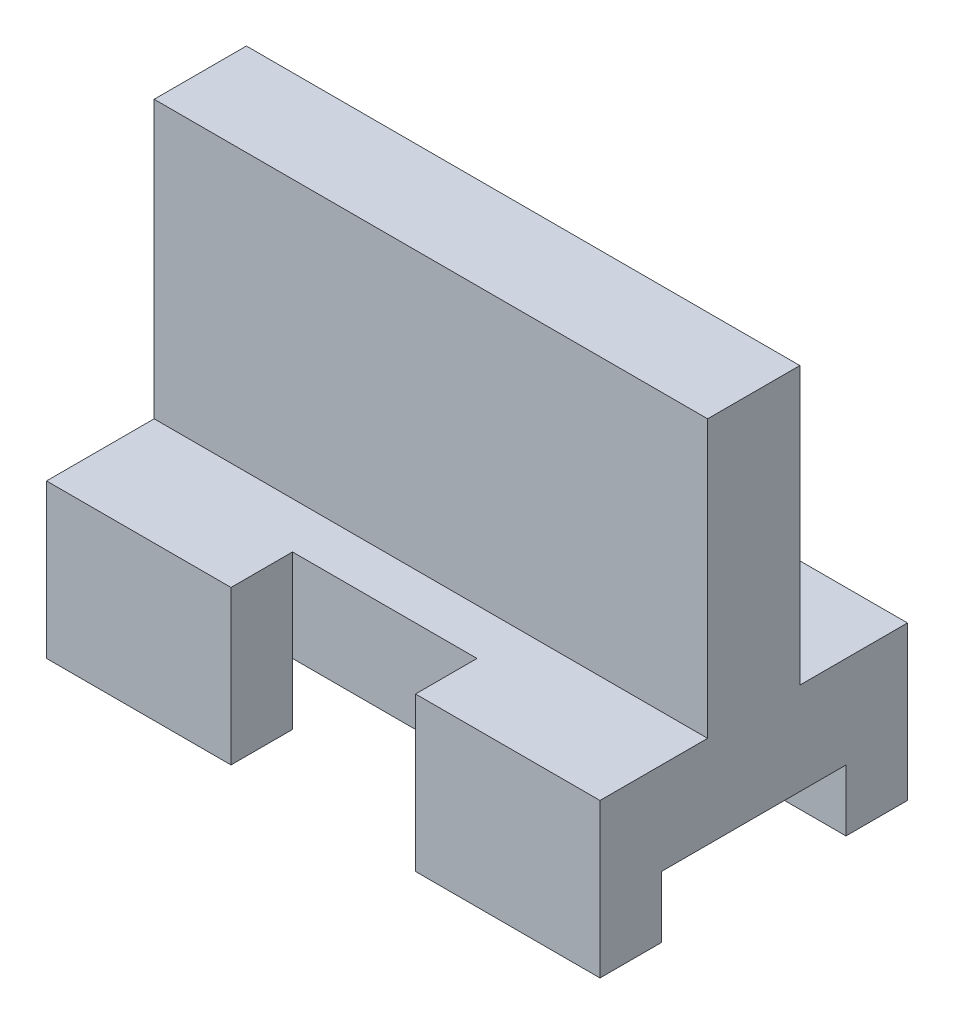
from build123d import *

# Parameters (mm, degrees)
SKETCH_1_W          = 90
SKETCH_1_H          = 50
EXTRUDE_1_DEPTH     = 25
SKETCH_2_W          = 90
SKETCH_2_H          = 15
EXTRUDE_2_DEPTH     = 45
SKETCH_3_W          = 30
SKETCH_3_H          = 10
CUT_EXTRUDE_1_DEPTH = 113.361025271
SKETCH_4_W          = 30
SKETCH_4_H          = 10
CUT_EXTRUDE_2_DEPTH = 125.49899598


with BuildPart() as part:
    # Sketch 1 → Extrude 1 (new body)
    with BuildSketch(Plane(origin=(0, 0, 0), x_dir=(1, 0, 0), z_dir=(0, 1, 0))):
        with Locations((45, 25)):
            Rectangle(SKETCH_1_W, SKETCH_1_H)
    extrude(amount=EXTRUDE_1_DEPTH)

    # Sketch 2 → Extrude 2 (add)
    with BuildSketch(Plane(origin=(0, 25, 0), x_dir=(1, 0, 0), z_dir=(0, 1, 0))):
        with Locations((45, 25)):
            Rectangle(SKETCH_2_W, SKETCH_2_H)
    extrude(amount=EXTRUDE_2_DEPTH)

    # Sketch 3 → Cut-Extrude 1 (cut, through all)
    with BuildSketch(Plane(origin=(0, 25, 0), x_dir=(1, 0, 0), z_dir=(0, 1, 0))):
        with Locations((45, 5)):
            Rectangle(SKETCH_3_W, SKETCH_3_H)
        with Locations((45, 45)):
            Rectangle(SKETCH_3_W, SKETCH_3_H)
    extrude(amount=-CUT_EXTRUDE_1_DEPTH, mode=Mode.SUBTRACT)

    # Sketch 4 → Cut-Extrude 2 (cut, through all)
    with BuildSketch(Plane(origin=(90, 0, 0), x_dir=(0, 0, -1), z_dir=(1, 0, 0))):
        with Locations((25, 5)):
            Rectangle(SKETCH_4_W, SKETCH_4_H)
    extrude(amount=-CUT_EXTRUDE_2_DEPTH, mode=Mode.SUBTRACT)


solid = part.part
